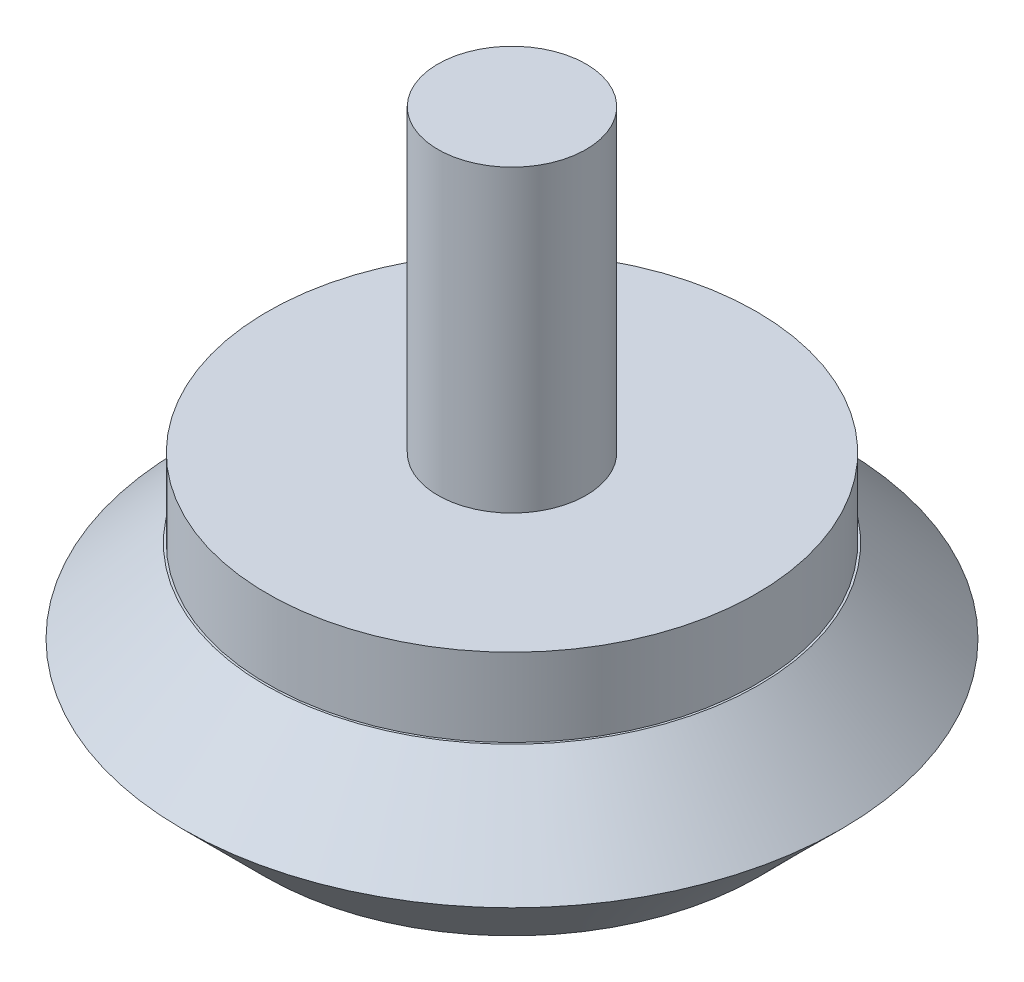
ISO-10303-21;
HEADER;
FILE_DESCRIPTION(('STEP AP214'),'2;1');
FILE_NAME('part.step','',(''),(''),'','','');
FILE_SCHEMA(('AUTOMOTIVE_DESIGN { 1 0 10303 214 1 1 1 1 }'));
ENDSEC;
DATA;
#1=APPLICATION_CONTEXT('core data for automotive mechanical design processes');
#2=APPLICATION_PROTOCOL_DEFINITION('international standard','automotive_design',2000,#1);
#3=PRODUCT_CONTEXT('',#1,'mechanical');
#4=PRODUCT('Part','Part','',(#3));
#5=PRODUCT_RELATED_PRODUCT_CATEGORY('part','',(#4));
#6=PRODUCT_DEFINITION_FORMATION('','',#4);
#7=PRODUCT_DEFINITION_CONTEXT('part definition',#1,'design');
#8=PRODUCT_DEFINITION('design','',#6,#7);
#9=PRODUCT_DEFINITION_SHAPE('','',#8);
#10=(LENGTH_UNIT() NAMED_UNIT(*) SI_UNIT(.MILLI.,.METRE.));
#11=(NAMED_UNIT(*) PLANE_ANGLE_UNIT() SI_UNIT($,.RADIAN.));
#12=(NAMED_UNIT(*) SI_UNIT($,.STERADIAN.) SOLID_ANGLE_UNIT());
#13=UNCERTAINTY_MEASURE_WITH_UNIT(LENGTH_MEASURE(1.E-05),#10,'distance_accuracy_value','');
#14=(GEOMETRIC_REPRESENTATION_CONTEXT(3) GLOBAL_UNCERTAINTY_ASSIGNED_CONTEXT((#13)) GLOBAL_UNIT_ASSIGNED_CONTEXT((#10,
#11,#12)) REPRESENTATION_CONTEXT('',''));
#15=CARTESIAN_POINT('',(0.,0.,0.));
#16=DIRECTION('',(0.,0.,1.));
#17=DIRECTION('',(1.,0.,0.));
#18=AXIS2_PLACEMENT_3D('',#15,#16,#17);
#19=CARTESIAN_POINT('',(-10.6931968,0.,10.6931968));
#20=DIRECTION('',(0.,-1.,0.));
#21=DIRECTION('',(0.,0.,-1.));
#22=AXIS2_PLACEMENT_3D('',#19,#20,#21);
#23=PLANE('',#22);
#24=CARTESIAN_POINT('',(0.,0.,0.));
#25=DIRECTION('',(0.,1.,0.));
#26=DIRECTION('',(0.,0.,1.));
#27=AXIS2_PLACEMENT_3D('',#24,#25,#26);
#28=CIRCLE('',#27,10.5664);
#29=CARTESIAN_POINT('',(0.,0.,10.5664));
#30=VERTEX_POINT('',#29);
#31=EDGE_CURVE('E18',#30,#30,#28,.F.);
#32=ORIENTED_EDGE('',*,*,#31,.T.);
#33=EDGE_LOOP('',(#32));
#34=FACE_BOUND('',#33,.T.);
#35=ADVANCED_FACE('F14',(#34),#23,.T.);
#36=CARTESIAN_POINT('',(0.,0.,0.));
#37=DIRECTION('',(0.,1.,0.));
#38=DIRECTION('',(0.,0.,1.));
#39=AXIS2_PLACEMENT_3D('',#36,#37,#38);
#40=CONICAL_SURFACE('',#39,10.5664,0.785398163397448);
#41=ORIENTED_EDGE('',*,*,#31,.F.);
#42=EDGE_LOOP('',(#41));
#43=FACE_BOUND('',#42,.T.);
#44=CARTESIAN_POINT('',(0.,3.556,0.));
#45=DIRECTION('',(0.,-1.,0.));
#46=DIRECTION('',(0.,0.,-1.));
#47=AXIS2_PLACEMENT_3D('',#44,#45,#46);
#48=CIRCLE('',#47,14.1224);
#49=CARTESIAN_POINT('',(0.,3.556,-14.1224));
#50=VERTEX_POINT('',#49);
#51=EDGE_CURVE('E34',#50,#50,#48,.T.);
#52=ORIENTED_EDGE('',*,*,#51,.T.);
#53=EDGE_LOOP('',(#52));
#54=FACE_BOUND('',#53,.T.);
#55=ADVANCED_FACE('F55',(#43,#54),#40,.T.);
#56=CARTESIAN_POINT('',(0.,7.112,0.));
#57=DIRECTION('',(0.,-1.,0.));
#58=DIRECTION('',(1.,0.,0.));
#59=AXIS2_PLACEMENT_3D('',#56,#57,#58);
#60=CONICAL_SURFACE('',#59,10.5664,0.785398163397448);
#61=CARTESIAN_POINT('',(0.,7.11200000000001,0.));
#62=DIRECTION('',(0.,-1.,0.));
#63=DIRECTION('',(1.,0.,0.));
#64=AXIS2_PLACEMENT_3D('',#61,#62,#63);
#65=CIRCLE('',#64,10.5664);
#66=CARTESIAN_POINT('',(10.5664,7.11200000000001,0.));
#67=VERTEX_POINT('',#66);
#68=EDGE_CURVE('E42',#67,#67,#65,.F.);
#69=ORIENTED_EDGE('',*,*,#68,.F.);
#70=EDGE_LOOP('',(#69));
#71=FACE_BOUND('',#70,.T.);
#72=ORIENTED_EDGE('',*,*,#51,.F.);
#73=EDGE_LOOP('',(#72));
#74=FACE_BOUND('',#73,.T.);
#75=ADVANCED_FACE('F57',(#71,#74),#60,.T.);
#76=CARTESIAN_POINT('',(-10.6931968,7.112,-10.6931968));
#77=DIRECTION('',(0.,1.,0.));
#78=DIRECTION('',(0.,0.,1.));
#79=AXIS2_PLACEMENT_3D('',#76,#77,#78);
#80=PLANE('',#79);
#81=CARTESIAN_POINT('',(0.,7.112,0.));
#82=DIRECTION('',(0.,-1.,0.));
#83=DIRECTION('',(0.,0.,-1.));
#84=AXIS2_PLACEMENT_3D('',#81,#82,#83);
#85=CIRCLE('',#84,10.4775);
#86=CARTESIAN_POINT('',(0.,7.112,-10.4775));
#87=VERTEX_POINT('',#86);
#88=EDGE_CURVE('E39',#87,#87,#85,.T.);
#89=ORIENTED_EDGE('',*,*,#88,.T.);
#90=EDGE_LOOP('',(#89));
#91=FACE_BOUND('',#90,.T.);
#92=ORIENTED_EDGE('',*,*,#68,.T.);
#93=EDGE_LOOP('',(#92));
#94=FACE_BOUND('',#93,.T.);
#95=ADVANCED_FACE('F63',(#91,#94),#80,.T.);
#96=CARTESIAN_POINT('',(0.,10.4648,0.));
#97=DIRECTION('',(0.,-1.,0.));
#98=DIRECTION('',(0.,0.,-1.));
#99=AXIS2_PLACEMENT_3D('',#96,#97,#98);
#100=CYLINDRICAL_SURFACE('',#99,10.4775);
#101=CARTESIAN_POINT('',(0.,10.4648,0.));
#102=DIRECTION('',(0.,-1.,0.));
#103=DIRECTION('',(0.,0.,-1.));
#104=AXIS2_PLACEMENT_3D('',#101,#102,#103);
#105=CIRCLE('',#104,10.4775);
#106=CARTESIAN_POINT('',(0.,10.4648,-10.4775));
#107=VERTEX_POINT('',#106);
#108=EDGE_CURVE('E31',#107,#107,#105,.F.);
#109=ORIENTED_EDGE('',*,*,#108,.F.);
#110=EDGE_LOOP('',(#109));
#111=FACE_BOUND('',#110,.T.);
#112=ORIENTED_EDGE('',*,*,#88,.F.);
#113=EDGE_LOOP('',(#112));
#114=FACE_BOUND('',#113,.T.);
#115=ADVANCED_FACE('F77',(#111,#114),#100,.T.);
#116=CARTESIAN_POINT('',(-10.60323,10.4648,-10.60323));
#117=DIRECTION('',(0.,1.,0.));
#118=DIRECTION('',(0.,0.,1.));
#119=AXIS2_PLACEMENT_3D('',#116,#117,#118);
#120=PLANE('',#119);
#121=CARTESIAN_POINT('',(0.,10.4648,0.));
#122=DIRECTION('',(0.,-1.,0.));
#123=DIRECTION('',(0.,0.,-1.));
#124=AXIS2_PLACEMENT_3D('',#121,#122,#123);
#125=CIRCLE('',#124,3.175);
#126=CARTESIAN_POINT('',(0.,10.4648,-3.175));
#127=VERTEX_POINT('',#126);
#128=EDGE_CURVE('E23',#127,#127,#125,.T.);
#129=ORIENTED_EDGE('',*,*,#128,.T.);
#130=EDGE_LOOP('',(#129));
#131=FACE_BOUND('',#130,.T.);
#132=ORIENTED_EDGE('',*,*,#108,.T.);
#133=EDGE_LOOP('',(#132));
#134=FACE_BOUND('',#133,.T.);
#135=ADVANCED_FACE('F73',(#131,#134),#120,.T.);
#136=CARTESIAN_POINT('',(-3.2131,23.3045,-3.2131));
#137=DIRECTION('',(0.,1.,0.));
#138=DIRECTION('',(0.,0.,1.));
#139=AXIS2_PLACEMENT_3D('',#136,#137,#138);
#140=PLANE('',#139);
#141=CARTESIAN_POINT('',(0.,23.3045,0.));
#142=DIRECTION('',(0.,-1.,0.));
#143=DIRECTION('',(0.,0.,-1.));
#144=AXIS2_PLACEMENT_3D('',#141,#142,#143);
#145=CIRCLE('',#144,3.175);
#146=CARTESIAN_POINT('',(0.,23.3045,-3.175));
#147=VERTEX_POINT('',#146);
#148=EDGE_CURVE('E10',#147,#147,#145,.F.);
#149=ORIENTED_EDGE('',*,*,#148,.T.);
#150=EDGE_LOOP('',(#149));
#151=FACE_BOUND('',#150,.T.);
#152=ADVANCED_FACE('F16',(#151),#140,.T.);
#153=CARTESIAN_POINT('',(0.,23.3045,0.));
#154=DIRECTION('',(0.,-1.,0.));
#155=DIRECTION('',(0.,0.,-1.));
#156=AXIS2_PLACEMENT_3D('',#153,#154,#155);
#157=CYLINDRICAL_SURFACE('',#156,3.175);
#158=ORIENTED_EDGE('',*,*,#128,.F.);
#159=EDGE_LOOP('',(#158));
#160=FACE_BOUND('',#159,.T.);
#161=ORIENTED_EDGE('',*,*,#148,.F.);
#162=EDGE_LOOP('',(#161));
#163=FACE_BOUND('',#162,.T.);
#164=ADVANCED_FACE('F67',(#160,#163),#157,.T.);
#165=CLOSED_SHELL('',(#35,#55,#75,#95,#115,#135,#152,#164));
#166=MANIFOLD_SOLID_BREP('B1',#165);
#167=ADVANCED_BREP_SHAPE_REPRESENTATION('',(#18,#166),#14);
#168=SHAPE_DEFINITION_REPRESENTATION(#9,#167);
ENDSEC;
END-ISO-10303-21;
